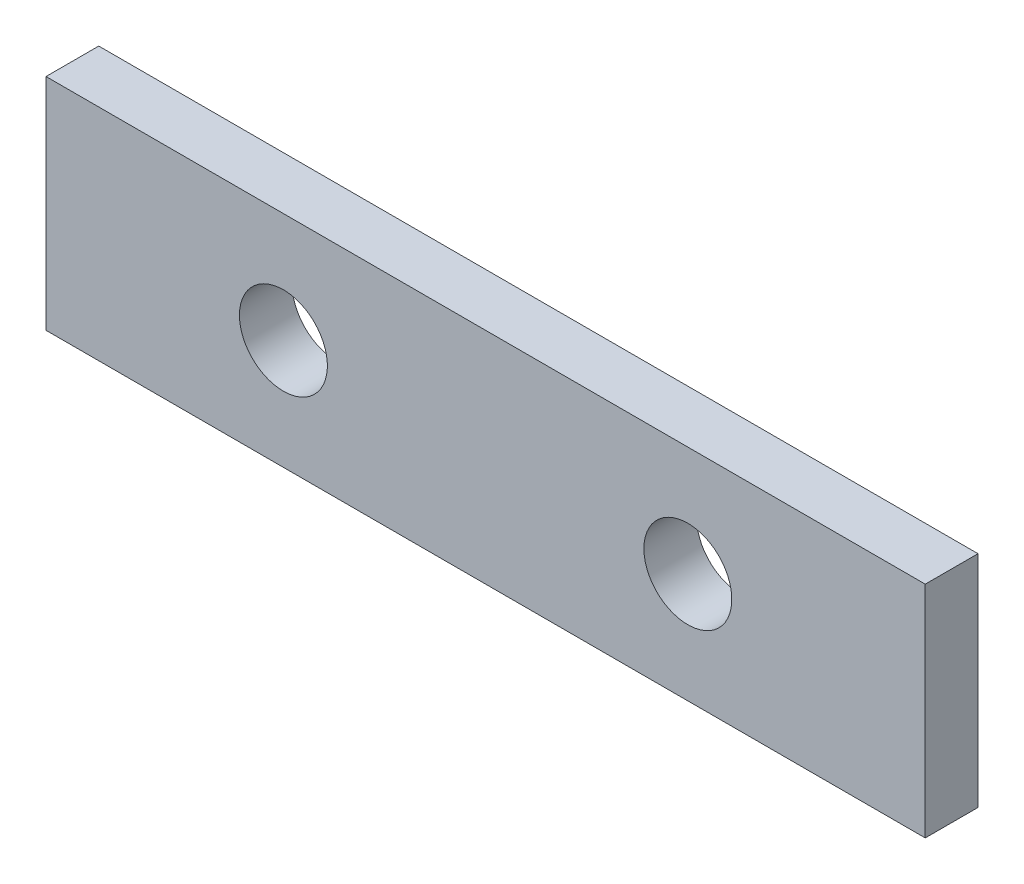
from build123d import *

# Parameters (mm, degrees)
ESQUISSE1_W      = 200
ESQUISSE1_H      = 50
ESQUISSE1_R      = 10
EXTRUSION1_DEPTH = 12


with BuildPart() as part:
    # Esquisse1 → Extrusion1 (new body)
    with BuildSketch(Plane.XY):
        with Locations((100, -25)):
            Rectangle(ESQUISSE1_W, ESQUISSE1_H)
        with Locations((146, -25)):
            Circle(ESQUISSE1_R, mode=Mode.SUBTRACT)
        with Locations((54, -25)):
            Circle(ESQUISSE1_R, mode=Mode.SUBTRACT)
    extrude(amount=EXTRUSION1_DEPTH)


solid = part.part
